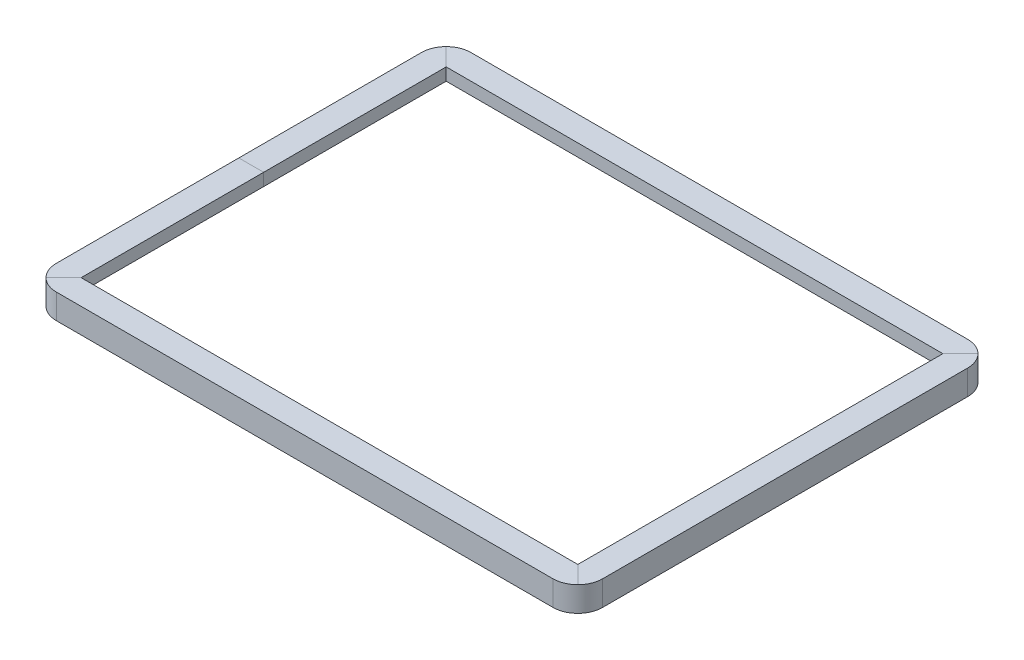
ISO-10303-21;
HEADER;
FILE_DESCRIPTION(('STEP AP214'),'2;1');
FILE_NAME('part.step','',(''),(''),'','','');
FILE_SCHEMA(('AUTOMOTIVE_DESIGN { 1 0 10303 214 1 1 1 1 }'));
ENDSEC;
DATA;
#1=APPLICATION_CONTEXT('core data for automotive mechanical design processes');
#2=APPLICATION_PROTOCOL_DEFINITION('international standard','automotive_design',2000,#1);
#3=PRODUCT_CONTEXT('',#1,'mechanical');
#4=PRODUCT('Part','Part','',(#3));
#5=PRODUCT_RELATED_PRODUCT_CATEGORY('part','',(#4));
#6=PRODUCT_DEFINITION_FORMATION('','',#4);
#7=PRODUCT_DEFINITION_CONTEXT('part definition',#1,'design');
#8=PRODUCT_DEFINITION('design','',#6,#7);
#9=PRODUCT_DEFINITION_SHAPE('','',#8);
#10=(LENGTH_UNIT() NAMED_UNIT(*) SI_UNIT(.MILLI.,.METRE.));
#11=(NAMED_UNIT(*) PLANE_ANGLE_UNIT() SI_UNIT($,.RADIAN.));
#12=(NAMED_UNIT(*) SI_UNIT($,.STERADIAN.) SOLID_ANGLE_UNIT());
#13=UNCERTAINTY_MEASURE_WITH_UNIT(LENGTH_MEASURE(1.E-05),#10,'distance_accuracy_value','');
#14=(GEOMETRIC_REPRESENTATION_CONTEXT(3) GLOBAL_UNCERTAINTY_ASSIGNED_CONTEXT((#13)) GLOBAL_UNIT_ASSIGNED_CONTEXT((#10,
#11,#12)) REPRESENTATION_CONTEXT('',''));
#15=CARTESIAN_POINT('',(0.,0.,0.));
#16=DIRECTION('',(0.,0.,1.));
#17=DIRECTION('',(1.,0.,0.));
#18=AXIS2_PLACEMENT_3D('',#15,#16,#17);
#19=CARTESIAN_POINT('',(110.6,5.,83.5));
#20=DIRECTION('',(0.,-1.,0.));
#21=DIRECTION('',(0.,0.,-1.));
#22=AXIS2_PLACEMENT_3D('',#19,#20,#21);
#23=PLANE('',#22);
#24=DIRECTION('',(0.707106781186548,0.,-0.707106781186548));
#25=VECTOR('',#24,1.);
#26=CARTESIAN_POINT('',(-110.3,5.,83.8));
#27=LINE('',#26,#25);
#28=CARTESIAN_POINT('',(-107.071067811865,5.,80.5710678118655));
#29=VERTEX_POINT('',#28);
#30=CARTESIAN_POINT('',(-100.,5.,73.5));
#31=VERTEX_POINT('',#30);
#32=EDGE_CURVE('E285',#29,#31,#27,.T.);
#33=ORIENTED_EDGE('',*,*,#32,.F.);
#34=CARTESIAN_POINT('',(-100.,5.,73.5));
#35=DIRECTION('',(0.,-1.,0.));
#36=DIRECTION('',(0.,0.,-1.));
#37=AXIS2_PLACEMENT_3D('',#34,#35,#36);
#38=CIRCLE('',#37,10.);
#39=CARTESIAN_POINT('',(-100.,5.,83.5));
#40=VERTEX_POINT('',#39);
#41=EDGE_CURVE('E391',#29,#40,#38,.F.);
#42=ORIENTED_EDGE('',*,*,#41,.T.);
#43=DIRECTION('',(-1.,0.,0.));
#44=VECTOR('',#43,1.);
#45=CARTESIAN_POINT('',(110.6,5.,83.5));
#46=LINE('',#45,#44);
#47=CARTESIAN_POINT('',(100.,5.,83.5));
#48=VERTEX_POINT('',#47);
#49=EDGE_CURVE('E295',#48,#40,#46,.T.);
#50=ORIENTED_EDGE('',*,*,#49,.F.);
#51=CARTESIAN_POINT('',(100.,5.,73.5));
#52=DIRECTION('',(0.,-1.,0.));
#53=DIRECTION('',(0.,0.,-1.));
#54=AXIS2_PLACEMENT_3D('',#51,#52,#53);
#55=CIRCLE('',#54,10.);
#56=CARTESIAN_POINT('',(107.071067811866,5.,80.5710678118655));
#57=VERTEX_POINT('',#56);
#58=EDGE_CURVE('E388',#48,#57,#55,.F.);
#59=ORIENTED_EDGE('',*,*,#58,.T.);
#60=DIRECTION('',(-0.707106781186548,0.,-0.707106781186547));
#61=VECTOR('',#60,1.);
#62=CARTESIAN_POINT('',(26.2,5.,-0.300000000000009));
#63=LINE('',#62,#61);
#64=CARTESIAN_POINT('',(100.,5.,73.5));
#65=VERTEX_POINT('',#64);
#66=EDGE_CURVE('E276',#57,#65,#63,.T.);
#67=ORIENTED_EDGE('',*,*,#66,.T.);
#68=DIRECTION('',(-1.,0.,0.));
#69=VECTOR('',#68,1.);
#70=CARTESIAN_POINT('',(110.6,5.,73.5));
#71=LINE('',#70,#69);
#72=EDGE_CURVE('E339',#65,#31,#71,.T.);
#73=ORIENTED_EDGE('',*,*,#72,.T.);
#74=EDGE_LOOP('',(#33,#42,#50,#59,#67,#73));
#75=FACE_BOUND('',#74,.T.);
#76=ADVANCED_FACE('F43',(#75),#23,.F.);
#77=CARTESIAN_POINT('',(110.6,5.,73.5));
#78=DIRECTION('',(0.,0.,1.));
#79=DIRECTION('',(1.,0.,0.));
#80=AXIS2_PLACEMENT_3D('',#77,#78,#79);
#81=PLANE('',#80);
#82=DIRECTION('',(0.,-1.,0.));
#83=VECTOR('',#82,1.);
#84=CARTESIAN_POINT('',(100.,5.,73.5));
#85=LINE('',#84,#83);
#86=CARTESIAN_POINT('',(100.,0.,73.5));
#87=VERTEX_POINT('',#86);
#88=EDGE_CURVE('E272',#65,#87,#85,.T.);
#89=ORIENTED_EDGE('',*,*,#88,.T.);
#90=DIRECTION('',(-1.,0.,0.));
#91=VECTOR('',#90,1.);
#92=CARTESIAN_POINT('',(110.6,0.,73.5));
#93=LINE('',#92,#91);
#94=CARTESIAN_POINT('',(-100.,0.,73.5000000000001));
#95=VERTEX_POINT('',#94);
#96=EDGE_CURVE('E344',#87,#95,#93,.T.);
#97=ORIENTED_EDGE('',*,*,#96,.T.);
#98=DIRECTION('',(0.,-1.,0.));
#99=VECTOR('',#98,1.);
#100=CARTESIAN_POINT('',(-100.,5.,73.5));
#101=LINE('',#100,#99);
#102=EDGE_CURVE('E305',#31,#95,#101,.T.);
#103=ORIENTED_EDGE('',*,*,#102,.F.);
#104=ORIENTED_EDGE('',*,*,#72,.F.);
#105=EDGE_LOOP('',(#89,#97,#103,#104));
#106=FACE_BOUND('',#105,.T.);
#107=ADVANCED_FACE('F537',(#106),#81,.F.);
#108=CARTESIAN_POINT('',(110.6,-5.,83.5));
#109=DIRECTION('',(0.,1.,0.));
#110=DIRECTION('',(0.,0.,1.));
#111=AXIS2_PLACEMENT_3D('',#108,#109,#110);
#112=PLANE('',#111);
#113=DIRECTION('',(-1.,0.,0.));
#114=VECTOR('',#113,1.);
#115=CARTESIAN_POINT('',(110.6,-5.,83.5));
#116=LINE('',#115,#114);
#117=CARTESIAN_POINT('',(100.,-5.,83.5));
#118=VERTEX_POINT('',#117);
#119=CARTESIAN_POINT('',(-100.,-5.,83.5));
#120=VERTEX_POINT('',#119);
#121=EDGE_CURVE('E343',#118,#120,#116,.T.);
#122=ORIENTED_EDGE('',*,*,#121,.T.);
#123=CARTESIAN_POINT('',(-100.,-5.,73.5));
#124=DIRECTION('',(0.,1.,0.));
#125=DIRECTION('',(0.,0.,1.));
#126=AXIS2_PLACEMENT_3D('',#123,#124,#125);
#127=CIRCLE('',#126,10.);
#128=CARTESIAN_POINT('',(-107.071067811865,-5.,80.5710678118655));
#129=VERTEX_POINT('',#128);
#130=EDGE_CURVE('E404',#120,#129,#127,.F.);
#131=ORIENTED_EDGE('',*,*,#130,.T.);
#132=DIRECTION('',(-0.707106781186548,0.,0.707106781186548));
#133=VECTOR('',#132,1.);
#134=CARTESIAN_POINT('',(-110.3,-5.,83.8));
#135=LINE('',#134,#133);
#136=CARTESIAN_POINT('',(-105.,-5.,78.5));
#137=VERTEX_POINT('',#136);
#138=EDGE_CURVE('E309',#137,#129,#135,.T.);
#139=ORIENTED_EDGE('',*,*,#138,.F.);
#140=DIRECTION('',(1.,0.,0.));
#141=VECTOR('',#140,1.);
#142=CARTESIAN_POINT('',(-105.,-5.,78.5));
#143=LINE('',#142,#141);
#144=CARTESIAN_POINT('',(105.,-5.,78.5));
#145=VERTEX_POINT('',#144);
#146=EDGE_CURVE('E211',#137,#145,#143,.T.);
#147=ORIENTED_EDGE('',*,*,#146,.T.);
#148=DIRECTION('',(0.707106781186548,0.,0.707106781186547));
#149=VECTOR('',#148,1.);
#150=CARTESIAN_POINT('',(26.2,-5.,-0.300000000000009));
#151=LINE('',#150,#149);
#152=CARTESIAN_POINT('',(107.071067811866,-5.,80.5710678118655));
#153=VERTEX_POINT('',#152);
#154=EDGE_CURVE('E231',#145,#153,#151,.T.);
#155=ORIENTED_EDGE('',*,*,#154,.T.);
#156=CARTESIAN_POINT('',(100.,-5.,73.5));
#157=DIRECTION('',(0.,1.,0.));
#158=DIRECTION('',(0.,0.,1.));
#159=AXIS2_PLACEMENT_3D('',#156,#157,#158);
#160=CIRCLE('',#159,10.);
#161=EDGE_CURVE('E401',#153,#118,#160,.F.);
#162=ORIENTED_EDGE('',*,*,#161,.T.);
#163=EDGE_LOOP('',(#122,#131,#139,#147,#155,#162));
#164=FACE_BOUND('',#163,.T.);
#165=ADVANCED_FACE('F426',(#164),#112,.F.);
#166=CARTESIAN_POINT('',(110.6,5.,83.5));
#167=DIRECTION('',(0.,0.,-1.));
#168=DIRECTION('',(-1.,0.,0.));
#169=AXIS2_PLACEMENT_3D('',#166,#167,#168);
#170=PLANE('',#169);
#171=ORIENTED_EDGE('',*,*,#49,.T.);
#172=DIRECTION('',(0.,1.,0.));
#173=VECTOR('',#172,1.);
#174=CARTESIAN_POINT('',(-100.,5.,83.5));
#175=LINE('',#174,#173);
#176=EDGE_CURVE('E398',#40,#120,#175,.F.);
#177=ORIENTED_EDGE('',*,*,#176,.T.);
#178=ORIENTED_EDGE('',*,*,#121,.F.);
#179=DIRECTION('',(0.,1.,0.));
#180=VECTOR('',#179,1.);
#181=CARTESIAN_POINT('',(100.,5.,83.5));
#182=LINE('',#181,#180);
#183=EDGE_CURVE('E394',#118,#48,#182,.T.);
#184=ORIENTED_EDGE('',*,*,#183,.T.);
#185=EDGE_LOOP('',(#171,#177,#178,#184));
#186=FACE_BOUND('',#185,.T.);
#187=ADVANCED_FACE('F433',(#186),#170,.F.);
#188=CARTESIAN_POINT('',(-110.,5.,84.1));
#189=DIRECTION('',(1.,0.,0.));
#190=DIRECTION('',(0.,0.,-1.));
#191=AXIS2_PLACEMENT_3D('',#188,#189,#190);
#192=PLANE('',#191);
#193=DIRECTION('',(0.,0.,-1.));
#194=VECTOR('',#193,1.);
#195=CARTESIAN_POINT('',(-110.,-5.,84.1));
#196=LINE('',#195,#194);
#197=CARTESIAN_POINT('',(-110.,-5.,73.5));
#198=VERTEX_POINT('',#197);
#199=CARTESIAN_POINT('',(-110.,-5.,0.));
#200=VERTEX_POINT('',#199);
#201=EDGE_CURVE('E294',#198,#200,#196,.T.);
#202=ORIENTED_EDGE('',*,*,#201,.F.);
#203=DIRECTION('',(0.,1.,0.));
#204=VECTOR('',#203,1.);
#205=CARTESIAN_POINT('',(-110.,5.,73.5));
#206=LINE('',#205,#204);
#207=CARTESIAN_POINT('',(-110.,5.,73.5));
#208=VERTEX_POINT('',#207);
#209=EDGE_CURVE('E381',#198,#208,#206,.T.);
#210=ORIENTED_EDGE('',*,*,#209,.T.);
#211=DIRECTION('',(0.,0.,-1.));
#212=VECTOR('',#211,1.);
#213=CARTESIAN_POINT('',(-110.,5.,84.1));
#214=LINE('',#213,#212);
#215=CARTESIAN_POINT('',(-110.,5.,0.));
#216=VERTEX_POINT('',#215);
#217=EDGE_CURVE('E291',#208,#216,#214,.T.);
#218=ORIENTED_EDGE('',*,*,#217,.T.);
#219=DIRECTION('',(0.,-1.,0.));
#220=VECTOR('',#219,1.);
#221=CARTESIAN_POINT('',(-110.,5.,0.));
#222=LINE('',#221,#220);
#223=EDGE_CURVE('E302',#216,#200,#222,.T.);
#224=ORIENTED_EDGE('',*,*,#223,.T.);
#225=EDGE_LOOP('',(#202,#210,#218,#224));
#226=FACE_BOUND('',#225,.T.);
#227=ADVANCED_FACE('F449',(#226),#192,.F.);
#228=CARTESIAN_POINT('',(-110.,-5.,84.1));
#229=DIRECTION('',(0.,1.,0.));
#230=DIRECTION('',(0.,0.,1.));
#231=AXIS2_PLACEMENT_3D('',#228,#229,#230);
#232=PLANE('',#231);
#233=ORIENTED_EDGE('',*,*,#138,.T.);
#234=CARTESIAN_POINT('',(-100.,-5.,73.5));
#235=DIRECTION('',(0.,1.,0.));
#236=DIRECTION('',(0.,0.,1.));
#237=AXIS2_PLACEMENT_3D('',#234,#235,#236);
#238=CIRCLE('',#237,10.);
#239=EDGE_CURVE('E407',#129,#198,#238,.F.);
#240=ORIENTED_EDGE('',*,*,#239,.T.);
#241=ORIENTED_EDGE('',*,*,#201,.T.);
#242=DIRECTION('',(1.,0.,0.));
#243=VECTOR('',#242,1.);
#244=CARTESIAN_POINT('',(-110.,-5.,0.));
#245=LINE('',#244,#243);
#246=CARTESIAN_POINT('',(-105.,-5.,0.));
#247=VERTEX_POINT('',#246);
#248=EDGE_CURVE('E317',#200,#247,#245,.T.);
#249=ORIENTED_EDGE('',*,*,#248,.T.);
#250=DIRECTION('',(0.,0.,1.));
#251=VECTOR('',#250,1.);
#252=CARTESIAN_POINT('',(-105.,-5.,-78.5));
#253=LINE('',#252,#251);
#254=EDGE_CURVE('E222',#247,#137,#253,.T.);
#255=ORIENTED_EDGE('',*,*,#254,.T.);
#256=EDGE_LOOP('',(#233,#240,#241,#249,#255));
#257=FACE_BOUND('',#256,.T.);
#258=ADVANCED_FACE('F445',(#257),#232,.F.);
#259=CARTESIAN_POINT('',(-100.,5.,84.1));
#260=DIRECTION('',(-1.,0.,0.));
#261=DIRECTION('',(0.,0.,1.));
#262=AXIS2_PLACEMENT_3D('',#259,#260,#261);
#263=PLANE('',#262);
#264=ORIENTED_EDGE('',*,*,#102,.T.);
#265=DIRECTION('',(0.,0.,-1.));
#266=VECTOR('',#265,1.);
#267=CARTESIAN_POINT('',(-100.,0.,84.1));
#268=LINE('',#267,#266);
#269=CARTESIAN_POINT('',(-100.,0.,0.));
#270=VERTEX_POINT('',#269);
#271=EDGE_CURVE('E503',#95,#270,#268,.T.);
#272=ORIENTED_EDGE('',*,*,#271,.T.);
#273=DIRECTION('',(0.,1.,0.));
#274=VECTOR('',#273,1.);
#275=CARTESIAN_POINT('',(-100.,5.,0.));
#276=LINE('',#275,#274);
#277=CARTESIAN_POINT('',(-100.,5.,0.));
#278=VERTEX_POINT('',#277);
#279=EDGE_CURVE('E321',#270,#278,#276,.T.);
#280=ORIENTED_EDGE('',*,*,#279,.T.);
#281=DIRECTION('',(0.,0.,-1.));
#282=VECTOR('',#281,1.);
#283=CARTESIAN_POINT('',(-100.,5.,84.1));
#284=LINE('',#283,#282);
#285=EDGE_CURVE('E298',#31,#278,#284,.T.);
#286=ORIENTED_EDGE('',*,*,#285,.F.);
#287=EDGE_LOOP('',(#264,#272,#280,#286));
#288=FACE_BOUND('',#287,.T.);
#289=ADVANCED_FACE('F534',(#288),#263,.F.);
#290=CARTESIAN_POINT('',(-110.,5.,84.1));
#291=DIRECTION('',(0.,-1.,0.));
#292=DIRECTION('',(0.,0.,-1.));
#293=AXIS2_PLACEMENT_3D('',#290,#291,#292);
#294=PLANE('',#293);
#295=ORIENTED_EDGE('',*,*,#217,.F.);
#296=CARTESIAN_POINT('',(-100.,5.,73.5));
#297=DIRECTION('',(0.,-1.,0.));
#298=DIRECTION('',(0.,0.,-1.));
#299=AXIS2_PLACEMENT_3D('',#296,#297,#298);
#300=CIRCLE('',#299,10.);
#301=EDGE_CURVE('E385',#208,#29,#300,.F.);
#302=ORIENTED_EDGE('',*,*,#301,.T.);
#303=ORIENTED_EDGE('',*,*,#32,.T.);
#304=ORIENTED_EDGE('',*,*,#285,.T.);
#305=DIRECTION('',(-1.,0.,0.));
#306=VECTOR('',#305,1.);
#307=CARTESIAN_POINT('',(-110.,5.,0.));
#308=LINE('',#307,#306);
#309=EDGE_CURVE('E324',#278,#216,#308,.T.);
#310=ORIENTED_EDGE('',*,*,#309,.T.);
#311=EDGE_LOOP('',(#295,#302,#303,#304,#310));
#312=FACE_BOUND('',#311,.T.);
#313=ADVANCED_FACE('F452',(#312),#294,.F.);
#314=CARTESIAN_POINT('',(-110.,5.,0.));
#315=DIRECTION('',(1.,0.,0.));
#316=DIRECTION('',(0.,0.,-1.));
#317=AXIS2_PLACEMENT_3D('',#314,#315,#316);
#318=PLANE('',#317);
#319=DIRECTION('',(0.,0.,-1.));
#320=VECTOR('',#319,1.);
#321=CARTESIAN_POINT('',(-110.,5.,0.));
#322=LINE('',#321,#320);
#323=CARTESIAN_POINT('',(-110.,5.,-73.5));
#324=VERTEX_POINT('',#323);
#325=EDGE_CURVE('E328',#216,#324,#322,.T.);
#326=ORIENTED_EDGE('',*,*,#325,.T.);
#327=DIRECTION('',(0.,1.,0.));
#328=VECTOR('',#327,1.);
#329=CARTESIAN_POINT('',(-110.,5.,-73.5));
#330=LINE('',#329,#328);
#331=CARTESIAN_POINT('',(-110.,-5.,-73.5));
#332=VERTEX_POINT('',#331);
#333=EDGE_CURVE('E370',#324,#332,#330,.F.);
#334=ORIENTED_EDGE('',*,*,#333,.T.);
#335=DIRECTION('',(0.,0.,-1.));
#336=VECTOR('',#335,1.);
#337=CARTESIAN_POINT('',(-110.,-5.,0.));
#338=LINE('',#337,#336);
#339=EDGE_CURVE('E332',#200,#332,#338,.T.);
#340=ORIENTED_EDGE('',*,*,#339,.F.);
#341=ORIENTED_EDGE('',*,*,#223,.F.);
#342=EDGE_LOOP('',(#326,#334,#340,#341));
#343=FACE_BOUND('',#342,.T.);
#344=ADVANCED_FACE('F460',(#343),#318,.F.);
#345=CARTESIAN_POINT('',(-110.,-5.,0.));
#346=DIRECTION('',(0.,1.,0.));
#347=DIRECTION('',(0.,0.,1.));
#348=AXIS2_PLACEMENT_3D('',#345,#346,#347);
#349=PLANE('',#348);
#350=ORIENTED_EDGE('',*,*,#339,.T.);
#351=CARTESIAN_POINT('',(-100.,-5.,-73.5));
#352=DIRECTION('',(0.,1.,0.));
#353=DIRECTION('',(0.,0.,1.));
#354=AXIS2_PLACEMENT_3D('',#351,#352,#353);
#355=CIRCLE('',#354,10.);
#356=CARTESIAN_POINT('',(-107.071067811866,-5.,-80.5710678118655));
#357=VERTEX_POINT('',#356);
#358=EDGE_CURVE('E373',#332,#357,#355,.F.);
#359=ORIENTED_EDGE('',*,*,#358,.T.);
#360=DIRECTION('',(-0.707106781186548,0.,-0.707106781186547));
#361=VECTOR('',#360,1.);
#362=CARTESIAN_POINT('',(-110.3,-5.,-83.8));
#363=LINE('',#362,#361);
#364=CARTESIAN_POINT('',(-105.,-5.,-78.5));
#365=VERTEX_POINT('',#364);
#366=EDGE_CURVE('E249',#365,#357,#363,.T.);
#367=ORIENTED_EDGE('',*,*,#366,.F.);
#368=EDGE_CURVE('E467',#365,#247,#253,.T.);
#369=ORIENTED_EDGE('',*,*,#368,.T.);
#370=ORIENTED_EDGE('',*,*,#248,.F.);
#371=EDGE_LOOP('',(#350,#359,#367,#369,#370));
#372=FACE_BOUND('',#371,.T.);
#373=ADVANCED_FACE('F466',(#372),#349,.F.);
#374=CARTESIAN_POINT('',(-100.,5.,0.));
#375=DIRECTION('',(-1.,0.,0.));
#376=DIRECTION('',(0.,0.,1.));
#377=AXIS2_PLACEMENT_3D('',#374,#375,#376);
#378=PLANE('',#377);
#379=ORIENTED_EDGE('',*,*,#279,.F.);
#380=DIRECTION('',(0.,0.,-1.));
#381=VECTOR('',#380,1.);
#382=CARTESIAN_POINT('',(-100.,0.,0.));
#383=LINE('',#382,#381);
#384=CARTESIAN_POINT('',(-100.,0.,-73.5));
#385=VERTEX_POINT('',#384);
#386=EDGE_CURVE('E499',#270,#385,#383,.T.);
#387=ORIENTED_EDGE('',*,*,#386,.T.);
#388=DIRECTION('',(0.,-1.,0.));
#389=VECTOR('',#388,1.);
#390=CARTESIAN_POINT('',(-100.,5.,-73.5));
#391=LINE('',#390,#389);
#392=CARTESIAN_POINT('',(-100.,5.,-73.5));
#393=VERTEX_POINT('',#392);
#394=EDGE_CURVE('E241',#393,#385,#391,.T.);
#395=ORIENTED_EDGE('',*,*,#394,.F.);
#396=DIRECTION('',(0.,0.,-1.));
#397=VECTOR('',#396,1.);
#398=CARTESIAN_POINT('',(-100.,5.,0.));
#399=LINE('',#398,#397);
#400=EDGE_CURVE('E313',#278,#393,#399,.T.);
#401=ORIENTED_EDGE('',*,*,#400,.F.);
#402=EDGE_LOOP('',(#379,#387,#395,#401));
#403=FACE_BOUND('',#402,.T.);
#404=ADVANCED_FACE('F530',(#403),#378,.F.);
#405=CARTESIAN_POINT('',(-110.,5.,0.));
#406=DIRECTION('',(0.,-1.,0.));
#407=DIRECTION('',(0.,0.,-1.));
#408=AXIS2_PLACEMENT_3D('',#405,#406,#407);
#409=PLANE('',#408);
#410=DIRECTION('',(0.707106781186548,0.,0.707106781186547));
#411=VECTOR('',#410,1.);
#412=CARTESIAN_POINT('',(-110.3,5.,-83.8));
#413=LINE('',#412,#411);
#414=CARTESIAN_POINT('',(-107.071067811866,5.,-80.5710678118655));
#415=VERTEX_POINT('',#414);
#416=EDGE_CURVE('E254',#415,#393,#413,.T.);
#417=ORIENTED_EDGE('',*,*,#416,.F.);
#418=CARTESIAN_POINT('',(-100.,5.,-73.5));
#419=DIRECTION('',(0.,-1.,0.));
#420=DIRECTION('',(0.,0.,-1.));
#421=AXIS2_PLACEMENT_3D('',#418,#419,#420);
#422=CIRCLE('',#421,10.);
#423=EDGE_CURVE('E367',#415,#324,#422,.F.);
#424=ORIENTED_EDGE('',*,*,#423,.T.);
#425=ORIENTED_EDGE('',*,*,#325,.F.);
#426=ORIENTED_EDGE('',*,*,#309,.F.);
#427=ORIENTED_EDGE('',*,*,#400,.T.);
#428=EDGE_LOOP('',(#417,#424,#425,#426,#427));
#429=FACE_BOUND('',#428,.T.);
#430=ADVANCED_FACE('F527',(#429),#409,.F.);
#431=CARTESIAN_POINT('',(110.,5.,-84.1));
#432=DIRECTION('',(0.,-1.,0.));
#433=DIRECTION('',(0.,0.,-1.));
#434=AXIS2_PLACEMENT_3D('',#431,#432,#433);
#435=PLANE('',#434);
#436=DIRECTION('',(0.,0.,1.));
#437=VECTOR('',#436,1.);
#438=CARTESIAN_POINT('',(110.,5.,-84.1));
#439=LINE('',#438,#437);
#440=CARTESIAN_POINT('',(110.,5.,-73.5));
#441=VERTEX_POINT('',#440);
#442=CARTESIAN_POINT('',(110.,5.,73.5));
#443=VERTEX_POINT('',#442);
#444=EDGE_CURVE('E279',#441,#443,#439,.T.);
#445=ORIENTED_EDGE('',*,*,#444,.F.);
#446=CARTESIAN_POINT('',(100.,5.,-73.5));
#447=DIRECTION('',(0.,-1.,0.));
#448=DIRECTION('',(0.,0.,-1.));
#449=AXIS2_PLACEMENT_3D('',#446,#447,#448);
#450=CIRCLE('',#449,10.);
#451=CARTESIAN_POINT('',(107.071067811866,5.,-80.5710678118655));
#452=VERTEX_POINT('',#451);
#453=EDGE_CURVE('E67',#441,#452,#450,.F.);
#454=ORIENTED_EDGE('',*,*,#453,.T.);
#455=DIRECTION('',(-0.707106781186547,0.,0.707106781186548));
#456=VECTOR('',#455,1.);
#457=CARTESIAN_POINT('',(-0.299999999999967,5.,26.8));
#458=LINE('',#457,#456);
#459=CARTESIAN_POINT('',(100.,5.,-73.5));
#460=VERTEX_POINT('',#459);
#461=EDGE_CURVE('E246',#452,#460,#458,.T.);
#462=ORIENTED_EDGE('',*,*,#461,.T.);
#463=DIRECTION('',(0.,0.,1.));
#464=VECTOR('',#463,1.);
#465=CARTESIAN_POINT('',(100.,5.,-84.1));
#466=LINE('',#465,#464);
#467=EDGE_CURVE('E280',#460,#65,#466,.T.);
#468=ORIENTED_EDGE('',*,*,#467,.T.);
#469=ORIENTED_EDGE('',*,*,#66,.F.);
#470=CARTESIAN_POINT('',(100.,5.,73.5));
#471=DIRECTION('',(0.,-1.,0.));
#472=DIRECTION('',(0.,0.,-1.));
#473=AXIS2_PLACEMENT_3D('',#470,#471,#472);
#474=CIRCLE('',#473,10.);
#475=EDGE_CURVE('E59',#57,#443,#474,.F.);
#476=ORIENTED_EDGE('',*,*,#475,.T.);
#477=EDGE_LOOP('',(#445,#454,#462,#468,#469,#476));
#478=FACE_BOUND('',#477,.T.);
#479=ADVANCED_FACE('F512',(#478),#435,.F.);
#480=CARTESIAN_POINT('',(100.,5.,-84.1));
#481=DIRECTION('',(1.,0.,0.));
#482=DIRECTION('',(0.,0.,-1.));
#483=AXIS2_PLACEMENT_3D('',#480,#481,#482);
#484=PLANE('',#483);
#485=DIRECTION('',(0.,-1.,0.));
#486=VECTOR('',#485,1.);
#487=CARTESIAN_POINT('',(100.,5.,-73.5));
#488=LINE('',#487,#486);
#489=CARTESIAN_POINT('',(100.,0.,-73.5));
#490=VERTEX_POINT('',#489);
#491=EDGE_CURVE('E240',#460,#490,#488,.T.);
#492=ORIENTED_EDGE('',*,*,#491,.T.);
#493=DIRECTION('',(0.,0.,1.));
#494=VECTOR('',#493,1.);
#495=CARTESIAN_POINT('',(100.,0.,-84.1));
#496=LINE('',#495,#494);
#497=EDGE_CURVE('E490',#490,#87,#496,.T.);
#498=ORIENTED_EDGE('',*,*,#497,.T.);
#499=ORIENTED_EDGE('',*,*,#88,.F.);
#500=ORIENTED_EDGE('',*,*,#467,.F.);
#501=EDGE_LOOP('',(#492,#498,#499,#500));
#502=FACE_BOUND('',#501,.T.);
#503=ADVANCED_FACE('F520',(#502),#484,.F.);
#504=CARTESIAN_POINT('',(110.,-5.,-84.1));
#505=DIRECTION('',(0.,1.,0.));
#506=DIRECTION('',(0.,0.,1.));
#507=AXIS2_PLACEMENT_3D('',#504,#505,#506);
#508=PLANE('',#507);
#509=DIRECTION('',(0.707106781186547,0.,-0.707106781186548));
#510=VECTOR('',#509,1.);
#511=CARTESIAN_POINT('',(-0.299999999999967,-5.,26.8));
#512=LINE('',#511,#510);
#513=CARTESIAN_POINT('',(105.,-5.,-78.5));
#514=VERTEX_POINT('',#513);
#515=CARTESIAN_POINT('',(107.071067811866,-5.,-80.5710678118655));
#516=VERTEX_POINT('',#515);
#517=EDGE_CURVE('E228',#514,#516,#512,.T.);
#518=ORIENTED_EDGE('',*,*,#517,.T.);
#519=CARTESIAN_POINT('',(100.,-5.,-73.5));
#520=DIRECTION('',(0.,1.,0.));
#521=DIRECTION('',(0.,0.,1.));
#522=AXIS2_PLACEMENT_3D('',#519,#520,#521);
#523=CIRCLE('',#522,10.);
#524=CARTESIAN_POINT('',(110.,-5.,-73.5));
#525=VERTEX_POINT('',#524);
#526=EDGE_CURVE('E11',#516,#525,#523,.F.);
#527=ORIENTED_EDGE('',*,*,#526,.T.);
#528=DIRECTION('',(0.,0.,1.));
#529=VECTOR('',#528,1.);
#530=CARTESIAN_POINT('',(110.,-5.,-84.1));
#531=LINE('',#530,#529);
#532=CARTESIAN_POINT('',(110.,-5.,73.5));
#533=VERTEX_POINT('',#532);
#534=EDGE_CURVE('E284',#525,#533,#531,.T.);
#535=ORIENTED_EDGE('',*,*,#534,.T.);
#536=CARTESIAN_POINT('',(100.,-5.,73.5));
#537=DIRECTION('',(0.,1.,0.));
#538=DIRECTION('',(0.,0.,1.));
#539=AXIS2_PLACEMENT_3D('',#536,#537,#538);
#540=CIRCLE('',#539,10.);
#541=EDGE_CURVE('E52',#533,#153,#540,.F.);
#542=ORIENTED_EDGE('',*,*,#541,.T.);
#543=ORIENTED_EDGE('',*,*,#154,.F.);
#544=DIRECTION('',(0.,0.,-1.));
#545=VECTOR('',#544,1.);
#546=CARTESIAN_POINT('',(105.,-5.,-78.5));
#547=LINE('',#546,#545);
#548=EDGE_CURVE('E202',#145,#514,#547,.T.);
#549=ORIENTED_EDGE('',*,*,#548,.T.);
#550=EDGE_LOOP('',(#518,#527,#535,#542,#543,#549));
#551=FACE_BOUND('',#550,.T.);
#552=ADVANCED_FACE('F227',(#551),#508,.F.);
#553=CARTESIAN_POINT('',(110.,5.,-84.1));
#554=DIRECTION('',(-1.,0.,0.));
#555=DIRECTION('',(0.,0.,1.));
#556=AXIS2_PLACEMENT_3D('',#553,#554,#555);
#557=PLANE('',#556);
#558=ORIENTED_EDGE('',*,*,#534,.F.);
#559=DIRECTION('',(0.,1.,0.));
#560=VECTOR('',#559,1.);
#561=CARTESIAN_POINT('',(110.,5.,-73.5));
#562=LINE('',#561,#560);
#563=EDGE_CURVE('E413',#525,#441,#562,.T.);
#564=ORIENTED_EDGE('',*,*,#563,.T.);
#565=ORIENTED_EDGE('',*,*,#444,.T.);
#566=DIRECTION('',(0.,1.,0.));
#567=VECTOR('',#566,1.);
#568=CARTESIAN_POINT('',(110.,5.,73.5));
#569=LINE('',#568,#567);
#570=EDGE_CURVE('E410',#443,#533,#569,.F.);
#571=ORIENTED_EDGE('',*,*,#570,.T.);
#572=EDGE_LOOP('',(#558,#564,#565,#571));
#573=FACE_BOUND('',#572,.T.);
#574=ADVANCED_FACE('F539',(#573),#557,.F.);
#575=CARTESIAN_POINT('',(-110.6,5.,-83.5));
#576=DIRECTION('',(0.,-1.,0.));
#577=DIRECTION('',(0.,0.,-1.));
#578=AXIS2_PLACEMENT_3D('',#575,#576,#577);
#579=PLANE('',#578);
#580=DIRECTION('',(1.,0.,0.));
#581=VECTOR('',#580,1.);
#582=CARTESIAN_POINT('',(-110.6,5.,-83.5));
#583=LINE('',#582,#581);
#584=CARTESIAN_POINT('',(-100.,5.,-83.5));
#585=VERTEX_POINT('',#584);
#586=CARTESIAN_POINT('',(100.,5.,-83.5));
#587=VERTEX_POINT('',#586);
#588=EDGE_CURVE('E265',#585,#587,#583,.T.);
#589=ORIENTED_EDGE('',*,*,#588,.F.);
#590=CARTESIAN_POINT('',(-100.,5.,-73.5));
#591=DIRECTION('',(0.,-1.,0.));
#592=DIRECTION('',(0.,0.,-1.));
#593=AXIS2_PLACEMENT_3D('',#590,#591,#592);
#594=CIRCLE('',#593,10.);
#595=EDGE_CURVE('E364',#585,#415,#594,.F.);
#596=ORIENTED_EDGE('',*,*,#595,.T.);
#597=ORIENTED_EDGE('',*,*,#416,.T.);
#598=DIRECTION('',(1.,0.,0.));
#599=VECTOR('',#598,1.);
#600=CARTESIAN_POINT('',(-110.6,5.,-73.5));
#601=LINE('',#600,#599);
#602=EDGE_CURVE('E258',#393,#460,#601,.T.);
#603=ORIENTED_EDGE('',*,*,#602,.T.);
#604=ORIENTED_EDGE('',*,*,#461,.F.);
#605=CARTESIAN_POINT('',(100.,5.,-73.5));
#606=DIRECTION('',(0.,-1.,0.));
#607=DIRECTION('',(0.,0.,-1.));
#608=AXIS2_PLACEMENT_3D('',#605,#606,#607);
#609=CIRCLE('',#608,10.);
#610=EDGE_CURVE('E361',#452,#587,#609,.F.);
#611=ORIENTED_EDGE('',*,*,#610,.T.);
#612=EDGE_LOOP('',(#589,#596,#597,#603,#604,#611));
#613=FACE_BOUND('',#612,.T.);
#614=ADVANCED_FACE('F523',(#613),#579,.F.);
#615=CARTESIAN_POINT('',(-110.6,5.,-73.5));
#616=DIRECTION('',(0.,0.,-1.));
#617=DIRECTION('',(-1.,0.,0.));
#618=AXIS2_PLACEMENT_3D('',#615,#616,#617);
#619=PLANE('',#618);
#620=ORIENTED_EDGE('',*,*,#394,.T.);
#621=DIRECTION('',(1.,0.,0.));
#622=VECTOR('',#621,1.);
#623=CARTESIAN_POINT('',(-110.6,0.,-73.5));
#624=LINE('',#623,#622);
#625=EDGE_CURVE('E269',#385,#490,#624,.T.);
#626=ORIENTED_EDGE('',*,*,#625,.T.);
#627=ORIENTED_EDGE('',*,*,#491,.F.);
#628=ORIENTED_EDGE('',*,*,#602,.F.);
#629=EDGE_LOOP('',(#620,#626,#627,#628));
#630=FACE_BOUND('',#629,.T.);
#631=ADVANCED_FACE('F517',(#630),#619,.F.);
#632=CARTESIAN_POINT('',(-110.6,-5.,-83.5));
#633=DIRECTION('',(0.,1.,0.));
#634=DIRECTION('',(0.,0.,1.));
#635=AXIS2_PLACEMENT_3D('',#632,#633,#634);
#636=PLANE('',#635);
#637=ORIENTED_EDGE('',*,*,#366,.T.);
#638=CARTESIAN_POINT('',(-100.,-5.,-73.5));
#639=DIRECTION('',(0.,1.,0.));
#640=DIRECTION('',(0.,0.,1.));
#641=AXIS2_PLACEMENT_3D('',#638,#639,#640);
#642=CIRCLE('',#641,10.);
#643=CARTESIAN_POINT('',(-100.,-5.,-83.5));
#644=VERTEX_POINT('',#643);
#645=EDGE_CURVE('E378',#357,#644,#642,.F.);
#646=ORIENTED_EDGE('',*,*,#645,.T.);
#647=DIRECTION('',(1.,0.,0.));
#648=VECTOR('',#647,1.);
#649=CARTESIAN_POINT('',(-110.6,-5.,-83.5));
#650=LINE('',#649,#648);
#651=CARTESIAN_POINT('',(100.,-5.,-83.5));
#652=VERTEX_POINT('',#651);
#653=EDGE_CURVE('E262',#644,#652,#650,.T.);
#654=ORIENTED_EDGE('',*,*,#653,.T.);
#655=CARTESIAN_POINT('',(100.,-5.,-73.5));
#656=DIRECTION('',(0.,1.,0.));
#657=DIRECTION('',(0.,0.,1.));
#658=AXIS2_PLACEMENT_3D('',#655,#656,#657);
#659=CIRCLE('',#658,10.);
#660=EDGE_CURVE('E238',#652,#516,#659,.F.);
#661=ORIENTED_EDGE('',*,*,#660,.T.);
#662=ORIENTED_EDGE('',*,*,#517,.F.);
#663=DIRECTION('',(-1.,0.,0.));
#664=VECTOR('',#663,1.);
#665=CARTESIAN_POINT('',(-105.,-5.,-78.5));
#666=LINE('',#665,#664);
#667=EDGE_CURVE('E215',#514,#365,#666,.T.);
#668=ORIENTED_EDGE('',*,*,#667,.T.);
#669=EDGE_LOOP('',(#637,#646,#654,#661,#662,#668));
#670=FACE_BOUND('',#669,.T.);
#671=ADVANCED_FACE('F235',(#670),#636,.F.);
#672=CARTESIAN_POINT('',(-110.6,5.,-83.5));
#673=DIRECTION('',(0.,0.,1.));
#674=DIRECTION('',(1.,0.,0.));
#675=AXIS2_PLACEMENT_3D('',#672,#673,#674);
#676=PLANE('',#675);
#677=ORIENTED_EDGE('',*,*,#653,.F.);
#678=DIRECTION('',(0.,1.,0.));
#679=VECTOR('',#678,1.);
#680=CARTESIAN_POINT('',(-100.,5.,-83.5));
#681=LINE('',#680,#679);
#682=EDGE_CURVE('E357',#644,#585,#681,.T.);
#683=ORIENTED_EDGE('',*,*,#682,.T.);
#684=ORIENTED_EDGE('',*,*,#588,.T.);
#685=DIRECTION('',(0.,1.,0.));
#686=VECTOR('',#685,1.);
#687=CARTESIAN_POINT('',(100.,5.,-83.5));
#688=LINE('',#687,#686);
#689=EDGE_CURVE('E354',#587,#652,#688,.F.);
#690=ORIENTED_EDGE('',*,*,#689,.T.);
#691=EDGE_LOOP('',(#677,#683,#684,#690));
#692=FACE_BOUND('',#691,.T.);
#693=ADVANCED_FACE('F544',(#692),#676,.F.);
#694=CARTESIAN_POINT('',(0.,0.,0.));
#695=DIRECTION('',(0.,1.,0.));
#696=DIRECTION('',(0.,0.,1.));
#697=AXIS2_PLACEMENT_3D('',#694,#695,#696);
#698=PLANE('',#697);
#699=DIRECTION('',(0.,0.,-1.));
#700=VECTOR('',#699,1.);
#701=CARTESIAN_POINT('',(105.,0.,-78.5));
#702=LINE('',#701,#700);
#703=CARTESIAN_POINT('',(105.,0.,78.5));
#704=VERTEX_POINT('',#703);
#705=CARTESIAN_POINT('',(105.,0.,-78.5));
#706=VERTEX_POINT('',#705);
#707=EDGE_CURVE('E205',#704,#706,#702,.T.);
#708=ORIENTED_EDGE('',*,*,#707,.F.);
#709=DIRECTION('',(1.,0.,0.));
#710=VECTOR('',#709,1.);
#711=CARTESIAN_POINT('',(-105.,0.,78.5));
#712=LINE('',#711,#710);
#713=CARTESIAN_POINT('',(-105.,0.,78.5));
#714=VERTEX_POINT('',#713);
#715=EDGE_CURVE('E233',#714,#704,#712,.T.);
#716=ORIENTED_EDGE('',*,*,#715,.F.);
#717=DIRECTION('',(0.,0.,1.));
#718=VECTOR('',#717,1.);
#719=CARTESIAN_POINT('',(-105.,0.,-78.5));
#720=LINE('',#719,#718);
#721=CARTESIAN_POINT('',(-105.,0.,-78.5));
#722=VERTEX_POINT('',#721);
#723=EDGE_CURVE('E480',#722,#714,#720,.T.);
#724=ORIENTED_EDGE('',*,*,#723,.F.);
#725=DIRECTION('',(-1.,0.,0.));
#726=VECTOR('',#725,1.);
#727=CARTESIAN_POINT('',(-105.,0.,-78.5));
#728=LINE('',#727,#726);
#729=EDGE_CURVE('E477',#706,#722,#728,.T.);
#730=ORIENTED_EDGE('',*,*,#729,.F.);
#731=EDGE_LOOP('',(#708,#716,#724,#730));
#732=FACE_BOUND('',#731,.T.);
#733=ORIENTED_EDGE('',*,*,#497,.F.);
#734=ORIENTED_EDGE('',*,*,#625,.F.);
#735=ORIENTED_EDGE('',*,*,#386,.F.);
#736=ORIENTED_EDGE('',*,*,#271,.F.);
#737=ORIENTED_EDGE('',*,*,#96,.F.);
#738=EDGE_LOOP('',(#733,#734,#735,#736,#737));
#739=FACE_BOUND('',#738,.T.);
#740=ADVANCED_FACE('F532',(#732,#739),#698,.F.);
#741=CARTESIAN_POINT('',(105.,-5.,-78.5));
#742=DIRECTION('',(1.,0.,0.));
#743=DIRECTION('',(0.,0.,-1.));
#744=AXIS2_PLACEMENT_3D('',#741,#742,#743);
#745=PLANE('',#744);
#746=ORIENTED_EDGE('',*,*,#707,.T.);
#747=DIRECTION('',(0.,1.,0.));
#748=VECTOR('',#747,1.);
#749=CARTESIAN_POINT('',(105.,-5.,-78.5));
#750=LINE('',#749,#748);
#751=EDGE_CURVE('E198',#514,#706,#750,.T.);
#752=ORIENTED_EDGE('',*,*,#751,.F.);
#753=ORIENTED_EDGE('',*,*,#548,.F.);
#754=DIRECTION('',(0.,1.,0.));
#755=VECTOR('',#754,1.);
#756=CARTESIAN_POINT('',(105.,-5.,78.5));
#757=LINE('',#756,#755);
#758=EDGE_CURVE('E487',#145,#704,#757,.T.);
#759=ORIENTED_EDGE('',*,*,#758,.T.);
#760=EDGE_LOOP('',(#746,#752,#753,#759));
#761=FACE_BOUND('',#760,.T.);
#762=ADVANCED_FACE('F200',(#761),#745,.F.);
#763=CARTESIAN_POINT('',(-105.,-5.,78.5));
#764=DIRECTION('',(0.,0.,1.));
#765=DIRECTION('',(1.,0.,0.));
#766=AXIS2_PLACEMENT_3D('',#763,#764,#765);
#767=PLANE('',#766);
#768=ORIENTED_EDGE('',*,*,#715,.T.);
#769=ORIENTED_EDGE('',*,*,#758,.F.);
#770=ORIENTED_EDGE('',*,*,#146,.F.);
#771=DIRECTION('',(0.,1.,0.));
#772=VECTOR('',#771,1.);
#773=CARTESIAN_POINT('',(-105.,-5.,78.5));
#774=LINE('',#773,#772);
#775=EDGE_CURVE('E491',#137,#714,#774,.T.);
#776=ORIENTED_EDGE('',*,*,#775,.T.);
#777=EDGE_LOOP('',(#768,#769,#770,#776));
#778=FACE_BOUND('',#777,.T.);
#779=ADVANCED_FACE('F732',(#778),#767,.F.);
#780=CARTESIAN_POINT('',(-105.,-5.,-78.5));
#781=DIRECTION('',(-1.,0.,0.));
#782=DIRECTION('',(0.,0.,1.));
#783=AXIS2_PLACEMENT_3D('',#780,#781,#782);
#784=PLANE('',#783);
#785=ORIENTED_EDGE('',*,*,#723,.T.);
#786=ORIENTED_EDGE('',*,*,#775,.F.);
#787=ORIENTED_EDGE('',*,*,#254,.F.);
#788=ORIENTED_EDGE('',*,*,#368,.F.);
#789=DIRECTION('',(0.,1.,0.));
#790=VECTOR('',#789,1.);
#791=CARTESIAN_POINT('',(-105.,-5.,-78.5));
#792=LINE('',#791,#790);
#793=EDGE_CURVE('E210',#365,#722,#792,.T.);
#794=ORIENTED_EDGE('',*,*,#793,.T.);
#795=EDGE_LOOP('',(#785,#786,#787,#788,#794));
#796=FACE_BOUND('',#795,.T.);
#797=ADVANCED_FACE('F556',(#796),#784,.F.);
#798=CARTESIAN_POINT('',(-105.,-5.,-78.5));
#799=DIRECTION('',(0.,0.,-1.));
#800=DIRECTION('',(-1.,0.,0.));
#801=AXIS2_PLACEMENT_3D('',#798,#799,#800);
#802=PLANE('',#801);
#803=ORIENTED_EDGE('',*,*,#729,.T.);
#804=ORIENTED_EDGE('',*,*,#793,.F.);
#805=ORIENTED_EDGE('',*,*,#667,.F.);
#806=ORIENTED_EDGE('',*,*,#751,.T.);
#807=EDGE_LOOP('',(#803,#804,#805,#806));
#808=FACE_BOUND('',#807,.T.);
#809=ADVANCED_FACE('F216',(#808),#802,.F.);
#810=CARTESIAN_POINT('',(-100.,5.,-73.5));
#811=DIRECTION('',(0.,1.,0.));
#812=DIRECTION('',(0.,0.,1.));
#813=AXIS2_PLACEMENT_3D('',#810,#811,#812);
#814=CYLINDRICAL_SURFACE('',#813,10.);
#815=ORIENTED_EDGE('',*,*,#358,.F.);
#816=ORIENTED_EDGE('',*,*,#333,.F.);
#817=ORIENTED_EDGE('',*,*,#423,.F.);
#818=ORIENTED_EDGE('',*,*,#595,.F.);
#819=ORIENTED_EDGE('',*,*,#682,.F.);
#820=ORIENTED_EDGE('',*,*,#645,.F.);
#821=EDGE_LOOP('',(#815,#816,#817,#818,#819,#820));
#822=FACE_BOUND('',#821,.T.);
#823=ADVANCED_FACE('F548',(#822),#814,.T.);
#824=CARTESIAN_POINT('',(-100.,5.,73.5));
#825=DIRECTION('',(0.,1.,0.));
#826=DIRECTION('',(0.,0.,1.));
#827=AXIS2_PLACEMENT_3D('',#824,#825,#826);
#828=CYLINDRICAL_SURFACE('',#827,10.);
#829=ORIENTED_EDGE('',*,*,#130,.F.);
#830=ORIENTED_EDGE('',*,*,#176,.F.);
#831=ORIENTED_EDGE('',*,*,#41,.F.);
#832=ORIENTED_EDGE('',*,*,#301,.F.);
#833=ORIENTED_EDGE('',*,*,#209,.F.);
#834=ORIENTED_EDGE('',*,*,#239,.F.);
#835=EDGE_LOOP('',(#829,#830,#831,#832,#833,#834));
#836=FACE_BOUND('',#835,.T.);
#837=ADVANCED_FACE('F440',(#836),#828,.T.);
#838=CARTESIAN_POINT('',(100.,5.,-73.5));
#839=DIRECTION('',(0.,1.,0.));
#840=DIRECTION('',(0.,0.,1.));
#841=AXIS2_PLACEMENT_3D('',#838,#839,#840);
#842=CYLINDRICAL_SURFACE('',#841,10.);
#843=ORIENTED_EDGE('',*,*,#660,.F.);
#844=ORIENTED_EDGE('',*,*,#689,.F.);
#845=ORIENTED_EDGE('',*,*,#610,.F.);
#846=ORIENTED_EDGE('',*,*,#453,.F.);
#847=ORIENTED_EDGE('',*,*,#563,.F.);
#848=ORIENTED_EDGE('',*,*,#526,.F.);
#849=EDGE_LOOP('',(#843,#844,#845,#846,#847,#848));
#850=FACE_BOUND('',#849,.T.);
#851=ADVANCED_FACE('F540',(#850),#842,.T.);
#852=CARTESIAN_POINT('',(100.,5.,73.5));
#853=DIRECTION('',(0.,1.,0.));
#854=DIRECTION('',(0.,0.,1.));
#855=AXIS2_PLACEMENT_3D('',#852,#853,#854);
#856=CYLINDRICAL_SURFACE('',#855,10.);
#857=ORIENTED_EDGE('',*,*,#541,.F.);
#858=ORIENTED_EDGE('',*,*,#570,.F.);
#859=ORIENTED_EDGE('',*,*,#475,.F.);
#860=ORIENTED_EDGE('',*,*,#58,.F.);
#861=ORIENTED_EDGE('',*,*,#183,.F.);
#862=ORIENTED_EDGE('',*,*,#161,.F.);
#863=EDGE_LOOP('',(#857,#858,#859,#860,#861,#862));
#864=FACE_BOUND('',#863,.T.);
#865=ADVANCED_FACE('F45',(#864),#856,.T.);
#866=CLOSED_SHELL('',(#76,#107,#165,#187,#227,#258,#289,#313,#344,#373,#404,#430,#479,#503,#552,
#574,#614,#631,#671,#693,#740,#762,#779,#797,#809,#823,#837,#851,#865));
#867=MANIFOLD_SOLID_BREP('B2',#866);
#868=ADVANCED_BREP_SHAPE_REPRESENTATION('',(#18,#867),#14);
#869=SHAPE_DEFINITION_REPRESENTATION(#9,#868);
ENDSEC;
END-ISO-10303-21;
